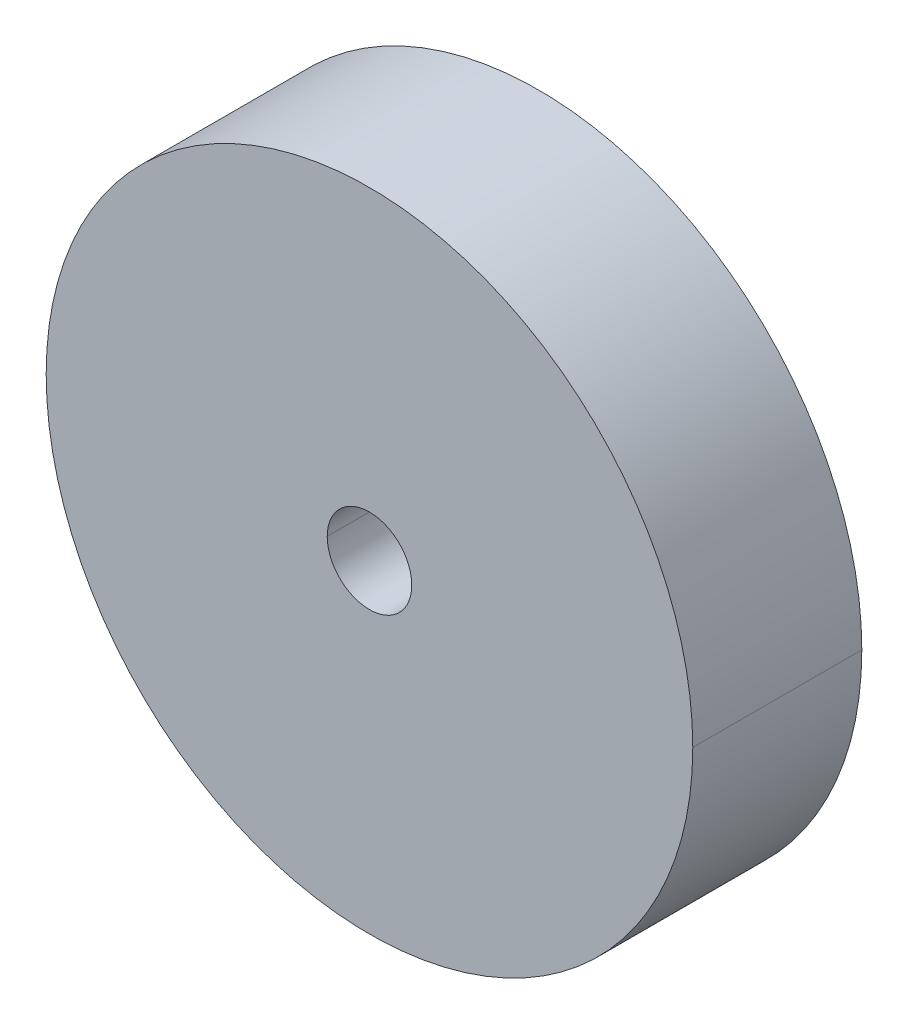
ISO-10303-21;
HEADER;
FILE_DESCRIPTION(('STEP AP214'),'2;1');
FILE_NAME('part.step','',(''),(''),'','','');
FILE_SCHEMA(('AUTOMOTIVE_DESIGN { 1 0 10303 214 1 1 1 1 }'));
ENDSEC;
DATA;
#1=APPLICATION_CONTEXT('core data for automotive mechanical design processes');
#2=APPLICATION_PROTOCOL_DEFINITION('international standard','automotive_design',2000,#1);
#3=PRODUCT_CONTEXT('',#1,'mechanical');
#4=PRODUCT('Part','Part','',(#3));
#5=PRODUCT_RELATED_PRODUCT_CATEGORY('part','',(#4));
#6=PRODUCT_DEFINITION_FORMATION('','',#4);
#7=PRODUCT_DEFINITION_CONTEXT('part definition',#1,'design');
#8=PRODUCT_DEFINITION('design','',#6,#7);
#9=PRODUCT_DEFINITION_SHAPE('','',#8);
#10=(LENGTH_UNIT() NAMED_UNIT(*) SI_UNIT(.MILLI.,.METRE.));
#11=(NAMED_UNIT(*) PLANE_ANGLE_UNIT() SI_UNIT($,.RADIAN.));
#12=(NAMED_UNIT(*) SI_UNIT($,.STERADIAN.) SOLID_ANGLE_UNIT());
#13=UNCERTAINTY_MEASURE_WITH_UNIT(LENGTH_MEASURE(1.E-05),#10,'distance_accuracy_value','');
#14=(GEOMETRIC_REPRESENTATION_CONTEXT(3) GLOBAL_UNCERTAINTY_ASSIGNED_CONTEXT((#13)) GLOBAL_UNIT_ASSIGNED_CONTEXT((#10,
#11,#12)) REPRESENTATION_CONTEXT('',''));
#15=CARTESIAN_POINT('',(0.,0.,0.));
#16=DIRECTION('',(0.,0.,1.));
#17=DIRECTION('',(1.,0.,0.));
#18=AXIS2_PLACEMENT_3D('',#15,#16,#17);
#19=CARTESIAN_POINT('',(0.,0.,2.));
#20=DIRECTION('',(0.,0.,-1.));
#21=DIRECTION('',(-1.,0.,0.));
#22=AXIS2_PLACEMENT_3D('',#19,#20,#21);
#23=CYLINDRICAL_SURFACE('',#22,0.5);
#24=DIRECTION('',(0.,0.,-1.));
#25=VECTOR('',#24,1.);
#26=CARTESIAN_POINT('',(0.5,0.,2.));
#27=LINE('',#26,#25);
#28=CARTESIAN_POINT('',(0.5,0.,2.));
#29=VERTEX_POINT('',#28);
#30=CARTESIAN_POINT('',(0.5,0.,0.));
#31=VERTEX_POINT('',#30);
#32=EDGE_CURVE('E88',#29,#31,#27,.T.);
#33=ORIENTED_EDGE('',*,*,#32,.F.);
#34=CARTESIAN_POINT('',(0.,0.,2.));
#35=DIRECTION('',(0.,0.,1.));
#36=DIRECTION('',(1.,0.,0.));
#37=AXIS2_PLACEMENT_3D('',#34,#35,#36);
#38=CIRCLE('',#37,0.5);
#39=CARTESIAN_POINT('',(-0.5,0.,2.));
#40=VERTEX_POINT('',#39);
#41=EDGE_CURVE('E81',#29,#40,#38,.T.);
#42=ORIENTED_EDGE('',*,*,#41,.T.);
#43=DIRECTION('',(0.,0.,-1.));
#44=VECTOR('',#43,1.);
#45=CARTESIAN_POINT('',(-0.5,0.,2.));
#46=LINE('',#45,#44);
#47=CARTESIAN_POINT('',(-0.5,0.,0.));
#48=VERTEX_POINT('',#47);
#49=EDGE_CURVE('E85',#40,#48,#46,.T.);
#50=ORIENTED_EDGE('',*,*,#49,.T.);
#51=CARTESIAN_POINT('',(0.,0.,0.));
#52=DIRECTION('',(0.,0.,1.));
#53=DIRECTION('',(1.,0.,0.));
#54=AXIS2_PLACEMENT_3D('',#51,#52,#53);
#55=CIRCLE('',#54,0.5);
#56=EDGE_CURVE('E11',#31,#48,#55,.T.);
#57=ORIENTED_EDGE('',*,*,#56,.F.);
#58=EDGE_LOOP('',(#33,#42,#50,#57));
#59=FACE_BOUND('',#58,.T.);
#60=ADVANCED_FACE('F17',(#59),#23,.F.);
#61=CARTESIAN_POINT('',(0.,0.,2.));
#62=DIRECTION('',(0.,0.,-1.));
#63=DIRECTION('',(-1.,0.,0.));
#64=AXIS2_PLACEMENT_3D('',#61,#62,#63);
#65=CYLINDRICAL_SURFACE('',#64,3.825);
#66=DIRECTION('',(0.,0.,-1.));
#67=VECTOR('',#66,1.);
#68=CARTESIAN_POINT('',(3.825,0.,2.));
#69=LINE('',#68,#67);
#70=CARTESIAN_POINT('',(3.825,0.,2.));
#71=VERTEX_POINT('',#70);
#72=CARTESIAN_POINT('',(3.825,0.,0.));
#73=VERTEX_POINT('',#72);
#74=EDGE_CURVE('E124',#71,#73,#69,.T.);
#75=ORIENTED_EDGE('',*,*,#74,.F.);
#76=CARTESIAN_POINT('',(0.,0.,2.));
#77=DIRECTION('',(0.,0.,1.));
#78=DIRECTION('',(1.,0.,0.));
#79=AXIS2_PLACEMENT_3D('',#76,#77,#78);
#80=CIRCLE('',#79,3.825);
#81=CARTESIAN_POINT('',(-3.825,0.,2.));
#82=VERTEX_POINT('',#81);
#83=EDGE_CURVE('E91',#82,#71,#80,.T.);
#84=ORIENTED_EDGE('',*,*,#83,.F.);
#85=DIRECTION('',(0.,0.,-1.));
#86=VECTOR('',#85,1.);
#87=CARTESIAN_POINT('',(-3.825,0.,2.));
#88=LINE('',#87,#86);
#89=CARTESIAN_POINT('',(-3.825,0.,0.));
#90=VERTEX_POINT('',#89);
#91=EDGE_CURVE('E226',#82,#90,#88,.T.);
#92=ORIENTED_EDGE('',*,*,#91,.T.);
#93=CARTESIAN_POINT('',(0.,0.,0.));
#94=DIRECTION('',(0.,0.,1.));
#95=DIRECTION('',(1.,0.,0.));
#96=AXIS2_PLACEMENT_3D('',#93,#94,#95);
#97=CIRCLE('',#96,3.825);
#98=EDGE_CURVE('E27',#90,#73,#97,.T.);
#99=ORIENTED_EDGE('',*,*,#98,.T.);
#100=EDGE_LOOP('',(#75,#84,#92,#99));
#101=FACE_BOUND('',#100,.T.);
#102=ADVANCED_FACE('F19',(#101),#65,.T.);
#103=CARTESIAN_POINT('',(0.,0.,0.));
#104=DIRECTION('',(0.,0.,1.));
#105=DIRECTION('',(1.,0.,0.));
#106=AXIS2_PLACEMENT_3D('',#103,#104,#105);
#107=PLANE('',#106);
#108=CARTESIAN_POINT('',(0.,0.,0.));
#109=DIRECTION('',(0.,0.,1.));
#110=DIRECTION('',(1.,0.,0.));
#111=AXIS2_PLACEMENT_3D('',#108,#109,#110);
#112=CIRCLE('',#111,0.5);
#113=EDGE_CURVE('E96',#48,#31,#112,.T.);
#114=ORIENTED_EDGE('',*,*,#113,.T.);
#115=ORIENTED_EDGE('',*,*,#56,.T.);
#116=EDGE_LOOP('',(#114,#115));
#117=FACE_BOUND('',#116,.T.);
#118=ORIENTED_EDGE('',*,*,#98,.F.);
#119=CARTESIAN_POINT('',(0.,0.,0.));
#120=DIRECTION('',(0.,0.,1.));
#121=DIRECTION('',(1.,0.,0.));
#122=AXIS2_PLACEMENT_3D('',#119,#120,#121);
#123=CIRCLE('',#122,3.825);
#124=EDGE_CURVE('E109',#73,#90,#123,.T.);
#125=ORIENTED_EDGE('',*,*,#124,.F.);
#126=EDGE_LOOP('',(#118,#125));
#127=FACE_BOUND('',#126,.T.);
#128=ADVANCED_FACE('F132',(#117,#127),#107,.F.);
#129=CARTESIAN_POINT('',(0.,0.,2.));
#130=DIRECTION('',(0.,0.,1.));
#131=DIRECTION('',(1.,0.,0.));
#132=AXIS2_PLACEMENT_3D('',#129,#130,#131);
#133=PLANE('',#132);
#134=CARTESIAN_POINT('',(0.,0.,2.));
#135=DIRECTION('',(0.,0.,1.));
#136=DIRECTION('',(1.,0.,0.));
#137=AXIS2_PLACEMENT_3D('',#134,#135,#136);
#138=CIRCLE('',#137,0.5);
#139=EDGE_CURVE('E95',#40,#29,#138,.T.);
#140=ORIENTED_EDGE('',*,*,#139,.F.);
#141=ORIENTED_EDGE('',*,*,#41,.F.);
#142=EDGE_LOOP('',(#140,#141));
#143=FACE_BOUND('',#142,.T.);
#144=ORIENTED_EDGE('',*,*,#83,.T.);
#145=CARTESIAN_POINT('',(0.,0.,2.));
#146=DIRECTION('',(0.,0.,1.));
#147=DIRECTION('',(1.,0.,0.));
#148=AXIS2_PLACEMENT_3D('',#145,#146,#147);
#149=CIRCLE('',#148,3.825);
#150=EDGE_CURVE('E21',#71,#82,#149,.T.);
#151=ORIENTED_EDGE('',*,*,#150,.T.);
#152=EDGE_LOOP('',(#144,#151));
#153=FACE_BOUND('',#152,.T.);
#154=ADVANCED_FACE('F99',(#143,#153),#133,.T.);
#155=CARTESIAN_POINT('',(0.,0.,2.));
#156=DIRECTION('',(0.,0.,-1.));
#157=DIRECTION('',(-1.,0.,0.));
#158=AXIS2_PLACEMENT_3D('',#155,#156,#157);
#159=CYLINDRICAL_SURFACE('',#158,3.825);
#160=ORIENTED_EDGE('',*,*,#150,.F.);
#161=ORIENTED_EDGE('',*,*,#74,.T.);
#162=ORIENTED_EDGE('',*,*,#124,.T.);
#163=ORIENTED_EDGE('',*,*,#91,.F.);
#164=EDGE_LOOP('',(#160,#161,#162,#163));
#165=FACE_BOUND('',#164,.T.);
#166=ADVANCED_FACE('F131',(#165),#159,.T.);
#167=CARTESIAN_POINT('',(0.,0.,2.));
#168=DIRECTION('',(0.,0.,-1.));
#169=DIRECTION('',(-1.,0.,0.));
#170=AXIS2_PLACEMENT_3D('',#167,#168,#169);
#171=CYLINDRICAL_SURFACE('',#170,0.5);
#172=ORIENTED_EDGE('',*,*,#139,.T.);
#173=ORIENTED_EDGE('',*,*,#32,.T.);
#174=ORIENTED_EDGE('',*,*,#113,.F.);
#175=ORIENTED_EDGE('',*,*,#49,.F.);
#176=EDGE_LOOP('',(#172,#173,#174,#175));
#177=FACE_BOUND('',#176,.T.);
#178=ADVANCED_FACE('F94',(#177),#171,.F.);
#179=CLOSED_SHELL('',(#60,#102,#128,#154,#166,#178));
#180=MANIFOLD_SOLID_BREP('B1',#179);
#181=ADVANCED_BREP_SHAPE_REPRESENTATION('',(#18,#180),#14);
#182=SHAPE_DEFINITION_REPRESENTATION(#9,#181);
ENDSEC;
END-ISO-10303-21;
